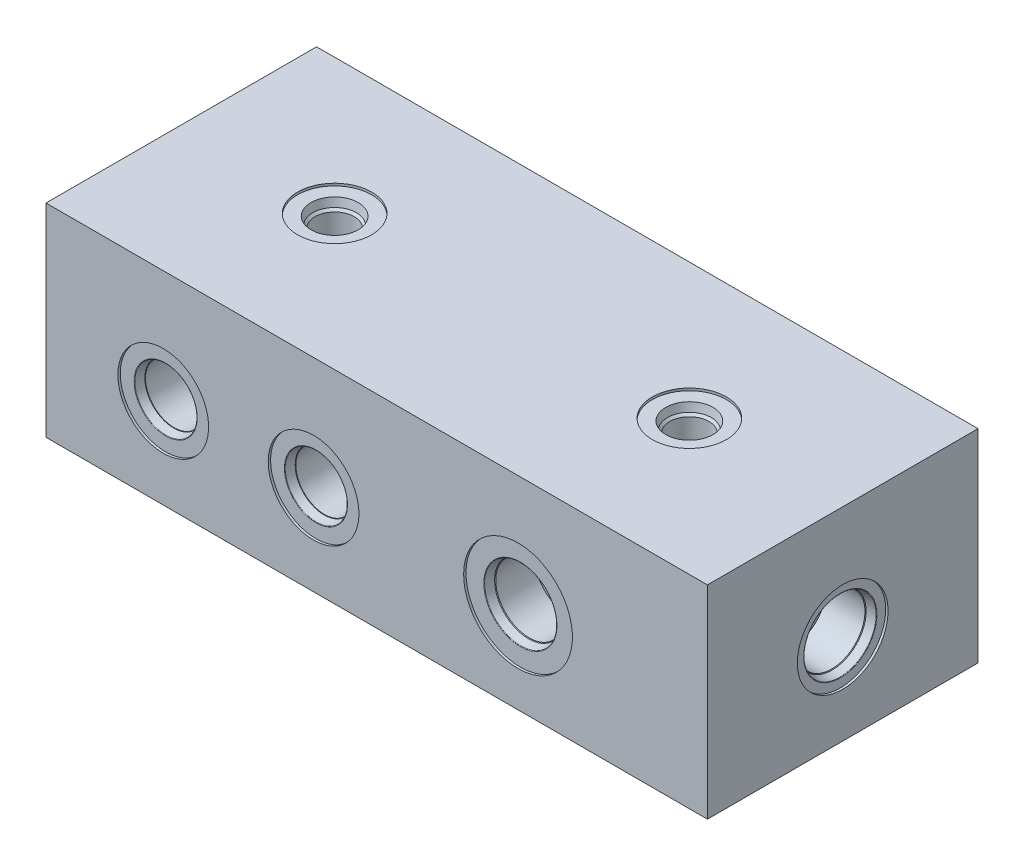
from build123d import *

# Parameters (mm, degrees)
LPATTERN1_COUNT          = 2
LPATTERN1_PITCH          = 50
BODY_MOVE_COPY1_ANGLE    = 180
LPATTERN2_COUNT          = 2
LPATTERN2_PITCH          = 118
BOSS_EXTRUDE1_DEPTH      = 37.5
BOSS_EXTRUDE1_DEPTH_BACK = 30
SKETCH5_W                = 220
SKETCH5_H                = 90


with BuildPart() as part:
    # Sketch1 → Revolve1 (revolve)
    with BuildSketch(Plane(origin=(0, 0, 0), x_dir=(1, 0, 0), z_dir=(0, 1, 0)), mode=Mode.PRIVATE) as revolve1_sk:
        with BuildLine():
            Line((100, 0), (94.734658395, -8.763))
            Line((94.734658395, -8.763), (24.2062, -8.763))
            ThreePointArc((24.2062, -8.763), (23.092648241, -9.224248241), (22.6314, -10.3378))
            Line((22.6314, -10.3378), (16.6624, -10.3378))
            Line((16.6624, -10.3378), (16.6624, -11.1125))
            Line((16.6624, -11.1125), (3.713097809, -11.1125))
            Line((3.713097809, -11.1125), (3.5179, -11.307697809))
            Line((3.5179, -11.307697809), (0.928594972, -12.0015))
            ThreePointArc((0.928594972, -12.0015), (0.826766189, -12.069539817), (0.7874, -12.185508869))
            Line((0.7874, -12.185508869), (0.7874, -15.0876))
            Line((0.7874, -15.0876), (0, -15.0876))
            Line((0, -15.0876), (0, 0))
            Line((0, 0), (100, 0))
        make_face()
    revolve(revolve1_sk.sketch.rotate(Axis((100, 0, 0), (-1, 0, 0)), 180), axis=Axis((100, 0, 0), (-1, 0, 0)))

    # Sketch2 → Revolve2 (revolve)
    with BuildSketch(Plane(origin=(0, 0, 0), x_dir=(1, 0, 0), z_dir=(0, 1, 0)), mode=Mode.PRIVATE) as revolve2_sk:
        with BuildLine():
            Line((54.0876, -44.2126), (54.0876, -45))
            Line((54.0876, -45), (39, -45))
            Line((39, -45), (39, 0))
            Line((39, 0), (45.3754, -3.830726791))
            Line((45.3754, -3.830726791), (45.3754, -22.911503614))
            ThreePointArc((45.3754, -22.911503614), (45.593306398, -23.710775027), (46.186721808, -24.288854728))
            Line((46.186721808, -24.288854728), (48.525, -25.584983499))
            Line((48.525, -25.584983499), (48.525, -41.375802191))
            Line((48.525, -41.375802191), (48.631297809, -41.4821))
            Line((48.631297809, -41.4821), (49.3251, -44.071405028))
            ThreePointArc((49.3251, -44.071405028), (49.393139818, -44.173233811), (49.50910887, -44.2126))
            Line((49.50910887, -44.2126), (54.0876, -44.2126))
        make_face()
    revolve2 = revolve(revolve2_sk.sketch.rotate(Axis((39, 0, 0), (0, 0, 1)), 180), axis=Axis((39, 0, 0), (0, 0, 1)))

    # LPattern1: Revolve2 ×2
    with Locations(*[(i * LPATTERN1_PITCH, 0, 0) for i in range(1, LPATTERN1_COUNT)]):
        add(revolve2)

    # Sketch3 → Revolve3 (revolve)
    with BuildSketch(Plane(origin=(0, 0, 0), x_dir=(1, 0, 0), z_dir=(0, 1, 0)), mode=Mode.PRIVATE) as revolve3_sk:
        with BuildLine():
            Line((63, 0), (54.237, 5.265341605))
            Line((54.237, 5.265341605), (54.237, 20.7938))
            ThreePointArc((54.237, 20.7938), (53.775751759, 21.907351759), (52.6622, 22.3686))
            Line((52.6622, 22.3686), (52.6622, 28.3376))
            Line((52.6622, 28.3376), (51.8875, 28.3376))
            Line((51.8875, 28.3376), (51.8875, 41.286902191))
            Line((51.8875, 41.286902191), (51.692302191, 41.4821))
            Line((51.692302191, 41.4821), (50.9985, 44.071405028))
            ThreePointArc((50.9985, 44.071405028), (50.930460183, 44.173233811), (50.814491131, 44.2126))
            Line((50.814491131, 44.2126), (44.91, 44.2126))
            Line((44.91, 44.2126), (44.91, 45))
            Line((44.91, 45), (63, 45))
            Line((63, 45), (63, 0))
        make_face()
    revolve(revolve3_sk.sketch.rotate(Axis((63, 0, 0), (0, 0, -1)), 180), axis=Axis((63, 0, 0), (0, 0, -1)))


with BuildPart() as body_2:
    # Mirror2: mirrored copy
    add(part.part.mirror(Plane(origin=(110, 0, 0), x_dir=(0, 0, 1), z_dir=(1, 0, 0))))


with BuildPart() as body_2_1:
    # Body-Move_Copy1: moved
    add(body_2.part.rotate(Axis((0, 0, 0), (1, 0, 0)), BODY_MOVE_COPY1_ANGLE))


with BuildPart() as part_1:
    add(part.part)

    # Sketch4 → Revolve4 (revolve)
    with BuildSketch(Plane.XY):
        Polygon((51, 0), (55.7625, 2.861598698), (55.7625, 21.2414), (57.5405, 21.2414), (57.5405, 33.305438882), (58.290761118, 34.0557), (58.85495, 36.71), (63.319, 36.71), (63.319, 37.5), (51, 37.5), align=None)
    revolve4 = revolve(axis=Axis((51, 0, 0), (0, 1, 0)))


with BuildPart() as body_2_2:
    add(body_2_1.part)

    # LPattern2: Revolve4 ×2
    with Locations(*[(i * LPATTERN2_PITCH, 0, 0) for i in range(1, LPATTERN2_COUNT)]):
        add(revolve4)


with BuildPart() as body_3:
    # Sketch5 → Boss-Extrude1 (new, two sides: drawn at the far end of the back side and taken through both)
    with BuildSketch(Plane(origin=(0, 0, 0), x_dir=(1, 0, 0), z_dir=(0, 1, 0)).offset(-BOSS_EXTRUDE1_DEPTH_BACK)):
        with Locations((110, 0)):
            Rectangle(SKETCH5_W, SKETCH5_H)
    extrude(amount=BOSS_EXTRUDE1_DEPTH + BOSS_EXTRUDE1_DEPTH_BACK)

    # Combine1: cut part, body 2
    add(part_1.part, mode=Mode.SUBTRACT)
    add(body_2_2.part, mode=Mode.SUBTRACT)


solid = body_3.part
